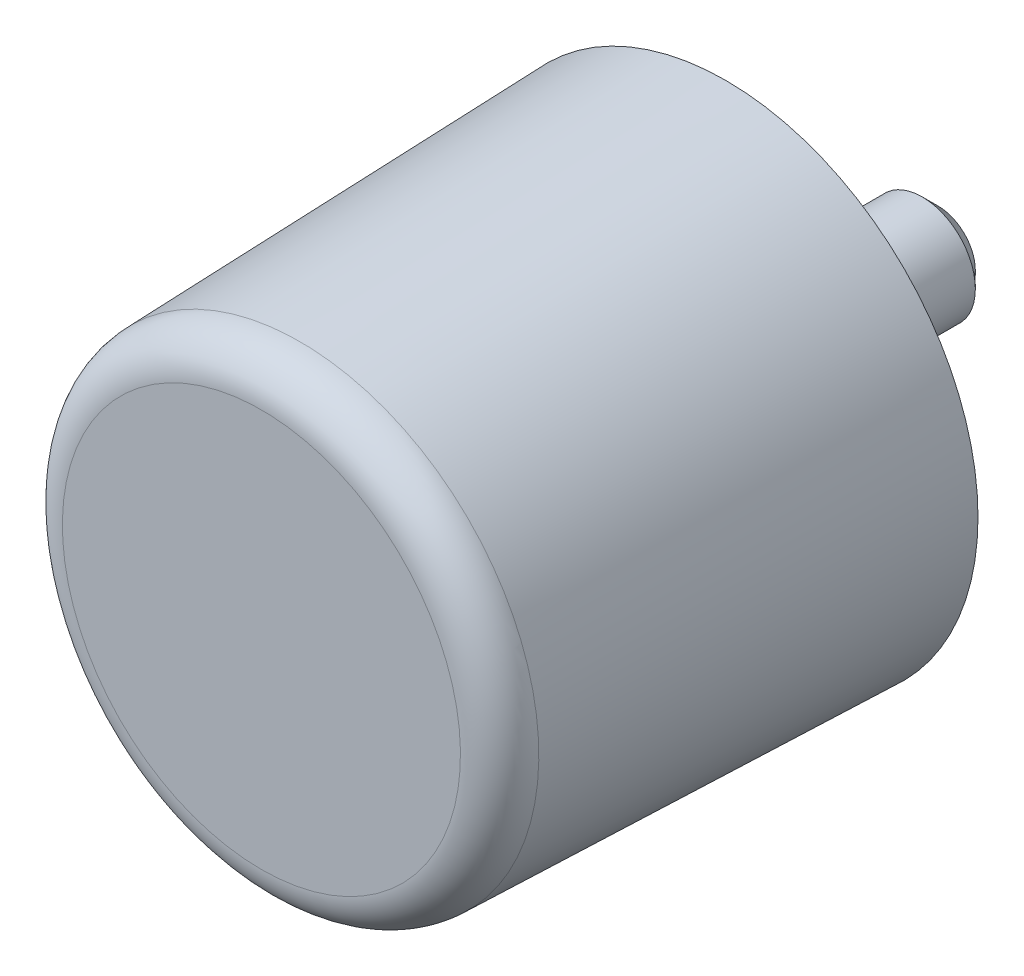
ISO-10303-21;
HEADER;
FILE_DESCRIPTION(('STEP AP214'),'2;1');
FILE_NAME('part.step','',(''),(''),'','','');
FILE_SCHEMA(('AUTOMOTIVE_DESIGN { 1 0 10303 214 1 1 1 1 }'));
ENDSEC;
DATA;
#1=APPLICATION_CONTEXT('core data for automotive mechanical design processes');
#2=APPLICATION_PROTOCOL_DEFINITION('international standard','automotive_design',2000,#1);
#3=PRODUCT_CONTEXT('',#1,'mechanical');
#4=PRODUCT('Part','Part','',(#3));
#5=PRODUCT_RELATED_PRODUCT_CATEGORY('part','',(#4));
#6=PRODUCT_DEFINITION_FORMATION('','',#4);
#7=PRODUCT_DEFINITION_CONTEXT('part definition',#1,'design');
#8=PRODUCT_DEFINITION('design','',#6,#7);
#9=PRODUCT_DEFINITION_SHAPE('','',#8);
#10=(LENGTH_UNIT() NAMED_UNIT(*) SI_UNIT(.MILLI.,.METRE.));
#11=(NAMED_UNIT(*) PLANE_ANGLE_UNIT() SI_UNIT($,.RADIAN.));
#12=(NAMED_UNIT(*) SI_UNIT($,.STERADIAN.) SOLID_ANGLE_UNIT());
#13=UNCERTAINTY_MEASURE_WITH_UNIT(LENGTH_MEASURE(1.E-05),#10,'distance_accuracy_value','');
#14=(GEOMETRIC_REPRESENTATION_CONTEXT(3) GLOBAL_UNCERTAINTY_ASSIGNED_CONTEXT((#13)) GLOBAL_UNIT_ASSIGNED_CONTEXT((#10,
#11,#12)) REPRESENTATION_CONTEXT('',''));
#15=CARTESIAN_POINT('',(0.,0.,0.));
#16=DIRECTION('',(0.,0.,1.));
#17=DIRECTION('',(1.,0.,0.));
#18=AXIS2_PLACEMENT_3D('',#15,#16,#17);
#19=CARTESIAN_POINT('',(0.,0.,35.));
#20=DIRECTION('',(0.,0.,1.));
#21=DIRECTION('',(0.,-1.,0.));
#22=AXIS2_PLACEMENT_3D('',#19,#20,#21);
#23=CYLINDRICAL_SURFACE('',#22,17.1);
#24=CARTESIAN_POINT('',(0.,0.,0.));
#25=DIRECTION('',(0.,0.,1.));
#26=DIRECTION('',(0.,-1.,0.));
#27=AXIS2_PLACEMENT_3D('',#24,#25,#26);
#28=CIRCLE('',#27,17.1);
#29=CARTESIAN_POINT('',(0.,-17.1,0.));
#30=VERTEX_POINT('',#29);
#31=EDGE_CURVE('E27',#30,#30,#28,.T.);
#32=ORIENTED_EDGE('',*,*,#31,.F.);
#33=EDGE_LOOP('',(#32));
#34=FACE_BOUND('',#33,.T.);
#35=CARTESIAN_POINT('',(0.,0.,0.0500000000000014));
#36=DIRECTION('',(0.,0.,1.));
#37=DIRECTION('',(0.,-1.,0.));
#38=AXIS2_PLACEMENT_3D('',#35,#36,#37);
#39=CIRCLE('',#38,17.1);
#40=CARTESIAN_POINT('',(0.,-17.1,0.0500000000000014));
#41=VERTEX_POINT('',#40);
#42=EDGE_CURVE('E44',#41,#41,#39,.T.);
#43=ORIENTED_EDGE('',*,*,#42,.T.);
#44=EDGE_LOOP('',(#43));
#45=FACE_BOUND('',#44,.T.);
#46=ADVANCED_FACE('F12',(#34,#45),#23,.F.);
#47=CARTESIAN_POINT('',(17.1,0.,0.));
#48=DIRECTION('',(0.,0.,1.));
#49=DIRECTION('',(0.,-1.,0.));
#50=AXIS2_PLACEMENT_3D('',#47,#48,#49);
#51=PLANE('',#50);
#52=CARTESIAN_POINT('',(0.,0.,0.));
#53=DIRECTION('',(0.,0.,1.));
#54=DIRECTION('',(0.,-1.,0.));
#55=AXIS2_PLACEMENT_3D('',#52,#53,#54);
#56=CIRCLE('',#55,19.);
#57=CARTESIAN_POINT('',(0.,-19.,0.));
#58=VERTEX_POINT('',#57);
#59=EDGE_CURVE('E32',#58,#58,#56,.T.);
#60=ORIENTED_EDGE('',*,*,#59,.F.);
#61=EDGE_LOOP('',(#60));
#62=FACE_BOUND('',#61,.T.);
#63=ORIENTED_EDGE('',*,*,#31,.T.);
#64=EDGE_LOOP('',(#63));
#65=FACE_BOUND('',#64,.T.);
#66=ADVANCED_FACE('F72',(#62,#65),#51,.F.);
#67=CARTESIAN_POINT('',(0.,0.,0.));
#68=DIRECTION('',(0.,0.,-1.));
#69=DIRECTION('',(0.,1.,0.));
#70=AXIS2_PLACEMENT_3D('',#67,#68,#69);
#71=CONICAL_SURFACE('',#70,19.,0.0311942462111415);
#72=CARTESIAN_POINT('',(0.,0.,32.0935675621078));
#73=DIRECTION('',(0.,0.,1.));
#74=DIRECTION('',(0.,-1.,0.));
#75=AXIS2_PLACEMENT_3D('',#72,#73,#74);
#76=CIRCLE('',#75,17.9985404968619);
#77=CARTESIAN_POINT('',(0.,-17.9985404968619,32.0935675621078));
#78=VERTEX_POINT('',#77);
#79=EDGE_CURVE('E35',#78,#78,#76,.T.);
#80=ORIENTED_EDGE('',*,*,#79,.F.);
#81=EDGE_LOOP('',(#80));
#82=FACE_BOUND('',#81,.T.);
#83=ORIENTED_EDGE('',*,*,#59,.T.);
#84=EDGE_LOOP('',(#83));
#85=FACE_BOUND('',#84,.T.);
#86=ADVANCED_FACE('F77',(#82,#85),#71,.T.);
#87=CARTESIAN_POINT('',(0.,0.,32.));
#88=DIRECTION('',(0.,0.,1.));
#89=DIRECTION('',(0.,-1.,0.));
#90=AXIS2_PLACEMENT_3D('',#87,#88,#89);
#91=TOROIDAL_SURFACE('',#90,15.,3.);
#92=ORIENTED_EDGE('',*,*,#79,.T.);
#93=EDGE_LOOP('',(#92));
#94=FACE_BOUND('',#93,.T.);
#95=CARTESIAN_POINT('',(0.,0.,35.));
#96=DIRECTION('',(0.,0.,1.));
#97=DIRECTION('',(0.,-1.,0.));
#98=AXIS2_PLACEMENT_3D('',#95,#96,#97);
#99=CIRCLE('',#98,15.);
#100=CARTESIAN_POINT('',(0.,-15.,35.));
#101=VERTEX_POINT('',#100);
#102=EDGE_CURVE('E38',#101,#101,#99,.T.);
#103=ORIENTED_EDGE('',*,*,#102,.F.);
#104=EDGE_LOOP('',(#103));
#105=FACE_BOUND('',#104,.T.);
#106=ADVANCED_FACE('F84',(#94,#105),#91,.T.);
#107=CARTESIAN_POINT('',(15.,0.,35.));
#108=DIRECTION('',(0.,0.,-1.));
#109=DIRECTION('',(0.,1.,0.));
#110=AXIS2_PLACEMENT_3D('',#107,#108,#109);
#111=PLANE('',#110);
#112=ORIENTED_EDGE('',*,*,#102,.T.);
#113=EDGE_LOOP('',(#112));
#114=FACE_BOUND('',#113,.T.);
#115=ADVANCED_FACE('F59',(#114),#111,.F.);
#116=CARTESIAN_POINT('',(0.,0.,0.));
#117=DIRECTION('',(0.,0.,1.));
#118=DIRECTION('',(0.,-1.,0.));
#119=AXIS2_PLACEMENT_3D('',#116,#117,#118);
#120=PLANE('',#119);
#121=CARTESIAN_POINT('',(0.,0.,0.));
#122=DIRECTION('',(0.,0.,1.));
#123=DIRECTION('',(0.,-1.,0.));
#124=AXIS2_PLACEMENT_3D('',#121,#122,#123);
#125=CIRCLE('',#124,17.05);
#126=CARTESIAN_POINT('',(0.,-17.05,0.));
#127=VERTEX_POINT('',#126);
#128=EDGE_CURVE('E41',#127,#127,#125,.T.);
#129=ORIENTED_EDGE('',*,*,#128,.F.);
#130=EDGE_LOOP('',(#129));
#131=FACE_BOUND('',#130,.T.);
#132=CARTESIAN_POINT('',(0.,0.,0.));
#133=DIRECTION('',(0.,0.,1.));
#134=DIRECTION('',(0.,-1.,0.));
#135=AXIS2_PLACEMENT_3D('',#132,#133,#134);
#136=CIRCLE('',#135,4.);
#137=CARTESIAN_POINT('',(0.,-4.,0.));
#138=VERTEX_POINT('',#137);
#139=EDGE_CURVE('E23',#138,#138,#136,.T.);
#140=ORIENTED_EDGE('',*,*,#139,.T.);
#141=EDGE_LOOP('',(#140));
#142=FACE_BOUND('',#141,.T.);
#143=ADVANCED_FACE('F53',(#131,#142),#120,.F.);
#144=CARTESIAN_POINT('',(0.,0.,0.));
#145=DIRECTION('',(0.,0.,1.));
#146=DIRECTION('',(0.,-1.,0.));
#147=AXIS2_PLACEMENT_3D('',#144,#145,#146);
#148=CONICAL_SURFACE('',#147,17.05,0.785398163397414);
#149=ORIENTED_EDGE('',*,*,#42,.F.);
#150=EDGE_LOOP('',(#149));
#151=FACE_BOUND('',#150,.T.);
#152=ORIENTED_EDGE('',*,*,#128,.T.);
#153=EDGE_LOOP('',(#152));
#154=FACE_BOUND('',#153,.T.);
#155=ADVANCED_FACE('F49',(#151,#154),#148,.T.);
#156=CARTESIAN_POINT('',(0.,0.,35.));
#157=DIRECTION('',(0.,0.,1.));
#158=DIRECTION('',(0.,-1.,0.));
#159=AXIS2_PLACEMENT_3D('',#156,#157,#158);
#160=CYLINDRICAL_SURFACE('',#159,4.);
#161=CARTESIAN_POINT('',(0.,0.,-14.8));
#162=DIRECTION('',(0.,0.,-1.));
#163=DIRECTION('',(0.,1.,0.));
#164=AXIS2_PLACEMENT_3D('',#161,#162,#163);
#165=CIRCLE('',#164,4.);
#166=CARTESIAN_POINT('',(0.,4.,-14.8));
#167=VERTEX_POINT('',#166);
#168=EDGE_CURVE('E8',#167,#167,#165,.F.);
#169=ORIENTED_EDGE('',*,*,#168,.T.);
#170=EDGE_LOOP('',(#169));
#171=FACE_BOUND('',#170,.T.);
#172=ORIENTED_EDGE('',*,*,#139,.F.);
#173=EDGE_LOOP('',(#172));
#174=FACE_BOUND('',#173,.T.);
#175=ADVANCED_FACE('F52',(#171,#174),#160,.T.);
#176=CARTESIAN_POINT('',(0.,0.,-16.));
#177=DIRECTION('',(0.,0.,-1.));
#178=DIRECTION('',(0.,1.,0.));
#179=AXIS2_PLACEMENT_3D('',#176,#177,#178);
#180=PLANE('',#179);
#181=CARTESIAN_POINT('',(0.,0.,-16.));
#182=DIRECTION('',(0.,0.,-1.));
#183=DIRECTION('',(0.,1.,0.));
#184=AXIS2_PLACEMENT_3D('',#181,#182,#183);
#185=CIRCLE('',#184,2.8);
#186=CARTESIAN_POINT('',(0.,2.8,-16.));
#187=VERTEX_POINT('',#186);
#188=EDGE_CURVE('E19',#187,#187,#185,.T.);
#189=ORIENTED_EDGE('',*,*,#188,.T.);
#190=EDGE_LOOP('',(#189));
#191=FACE_BOUND('',#190,.T.);
#192=ADVANCED_FACE('F64',(#191),#180,.T.);
#193=CARTESIAN_POINT('',(0.,0.,-16.));
#194=DIRECTION('',(0.,0.,1.));
#195=DIRECTION('',(0.,-1.,0.));
#196=AXIS2_PLACEMENT_3D('',#193,#194,#195);
#197=CONICAL_SURFACE('',#196,2.8,0.785398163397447);
#198=ORIENTED_EDGE('',*,*,#168,.F.);
#199=EDGE_LOOP('',(#198));
#200=FACE_BOUND('',#199,.T.);
#201=ORIENTED_EDGE('',*,*,#188,.F.);
#202=EDGE_LOOP('',(#201));
#203=FACE_BOUND('',#202,.T.);
#204=ADVANCED_FACE('F14',(#200,#203),#197,.T.);
#205=CLOSED_SHELL('',(#46,#66,#86,#106,#115,#143,#155,#175,#192,#204));
#206=MANIFOLD_SOLID_BREP('B1',#205);
#207=ADVANCED_BREP_SHAPE_REPRESENTATION('',(#18,#206),#14);
#208=SHAPE_DEFINITION_REPRESENTATION(#9,#207);
ENDSEC;
END-ISO-10303-21;
